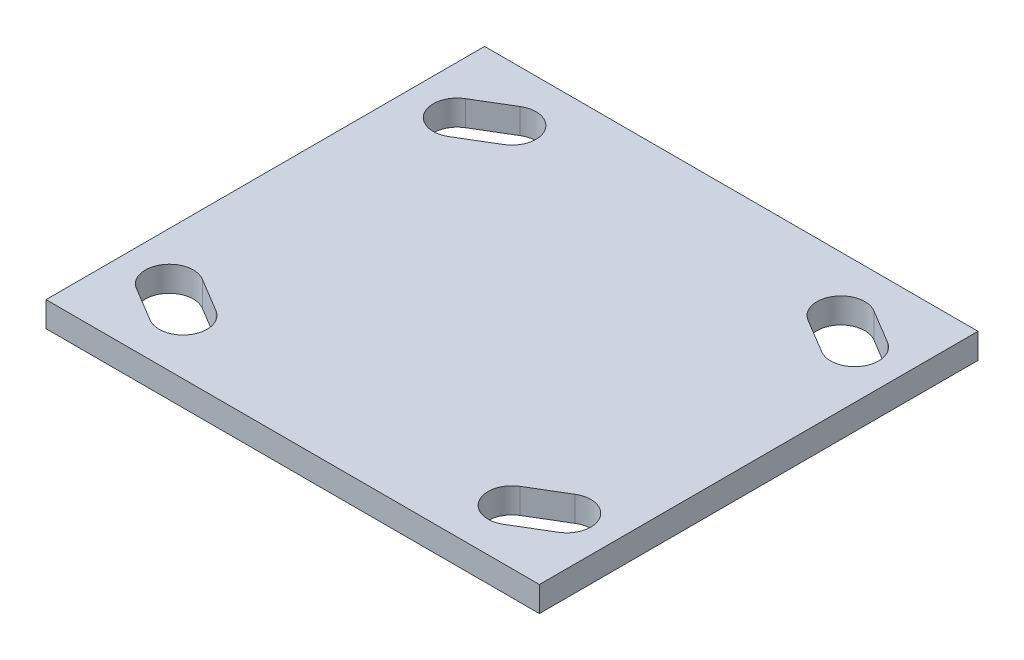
ISO-10303-21;
HEADER;
FILE_DESCRIPTION(('STEP AP214'),'2;1');
FILE_NAME('part.step','',(''),(''),'','','');
FILE_SCHEMA(('AUTOMOTIVE_DESIGN { 1 0 10303 214 1 1 1 1 }'));
ENDSEC;
DATA;
#1=APPLICATION_CONTEXT('core data for automotive mechanical design processes');
#2=APPLICATION_PROTOCOL_DEFINITION('international standard','automotive_design',2000,#1);
#3=PRODUCT_CONTEXT('',#1,'mechanical');
#4=PRODUCT('Part','Part','',(#3));
#5=PRODUCT_RELATED_PRODUCT_CATEGORY('part','',(#4));
#6=PRODUCT_DEFINITION_FORMATION('','',#4);
#7=PRODUCT_DEFINITION_CONTEXT('part definition',#1,'design');
#8=PRODUCT_DEFINITION('design','',#6,#7);
#9=PRODUCT_DEFINITION_SHAPE('','',#8);
#10=(LENGTH_UNIT() NAMED_UNIT(*) SI_UNIT(.MILLI.,.METRE.));
#11=(NAMED_UNIT(*) PLANE_ANGLE_UNIT() SI_UNIT($,.RADIAN.));
#12=(NAMED_UNIT(*) SI_UNIT($,.STERADIAN.) SOLID_ANGLE_UNIT());
#13=UNCERTAINTY_MEASURE_WITH_UNIT(LENGTH_MEASURE(1.E-05),#10,'distance_accuracy_value','');
#14=(GEOMETRIC_REPRESENTATION_CONTEXT(3) GLOBAL_UNCERTAINTY_ASSIGNED_CONTEXT((#13)) GLOBAL_UNIT_ASSIGNED_CONTEXT((#10,
#11,#12)) REPRESENTATION_CONTEXT('',''));
#15=CARTESIAN_POINT('',(0.,0.,0.));
#16=DIRECTION('',(0.,0.,1.));
#17=DIRECTION('',(1.,0.,0.));
#18=AXIS2_PLACEMENT_3D('',#15,#16,#17);
#19=CARTESIAN_POINT('',(-57.15,2.921,50.8));
#20=DIRECTION('',(1.,0.,0.));
#21=DIRECTION('',(0.,0.,-1.));
#22=AXIS2_PLACEMENT_3D('',#19,#20,#21);
#23=PLANE('',#22);
#24=DIRECTION('',(0.,0.,1.));
#25=VECTOR('',#24,1.);
#26=CARTESIAN_POINT('',(-57.15,-2.921,50.8));
#27=LINE('',#26,#25);
#28=CARTESIAN_POINT('',(-57.15,-2.921,-50.8));
#29=VERTEX_POINT('',#28);
#30=CARTESIAN_POINT('',(-57.15,-2.921,50.8));
#31=VERTEX_POINT('',#30);
#32=EDGE_CURVE('E628',#29,#31,#27,.T.);
#33=ORIENTED_EDGE('',*,*,#32,.T.);
#34=DIRECTION('',(0.,-1.,0.));
#35=VECTOR('',#34,1.);
#36=CARTESIAN_POINT('',(-57.15,2.921,50.8));
#37=LINE('',#36,#35);
#38=CARTESIAN_POINT('',(-57.15,2.921,50.8));
#39=VERTEX_POINT('',#38);
#40=EDGE_CURVE('E11',#39,#31,#37,.T.);
#41=ORIENTED_EDGE('',*,*,#40,.F.);
#42=DIRECTION('',(0.,0.,1.));
#43=VECTOR('',#42,1.);
#44=CARTESIAN_POINT('',(-57.15,2.921,50.8));
#45=LINE('',#44,#43);
#46=CARTESIAN_POINT('',(-57.15,2.921,-50.8));
#47=VERTEX_POINT('',#46);
#48=EDGE_CURVE('E637',#47,#39,#45,.T.);
#49=ORIENTED_EDGE('',*,*,#48,.F.);
#50=DIRECTION('',(0.,-1.,0.));
#51=VECTOR('',#50,1.);
#52=CARTESIAN_POINT('',(-57.15,2.921,-50.8));
#53=LINE('',#52,#51);
#54=EDGE_CURVE('E646',#47,#29,#53,.T.);
#55=ORIENTED_EDGE('',*,*,#54,.T.);
#56=EDGE_LOOP('',(#33,#41,#49,#55));
#57=FACE_BOUND('',#56,.T.);
#58=ADVANCED_FACE('F362',(#57),#23,.F.);
#59=CARTESIAN_POINT('',(-57.15,2.921,50.8));
#60=DIRECTION('',(0.,0.,-1.));
#61=DIRECTION('',(-1.,0.,0.));
#62=AXIS2_PLACEMENT_3D('',#59,#60,#61);
#63=PLANE('',#62);
#64=DIRECTION('',(1.,0.,0.));
#65=VECTOR('',#64,1.);
#66=CARTESIAN_POINT('',(-57.15,-2.921,50.8));
#67=LINE('',#66,#65);
#68=CARTESIAN_POINT('',(57.15,-2.921,50.8));
#69=VERTEX_POINT('',#68);
#70=EDGE_CURVE('E631',#31,#69,#67,.T.);
#71=ORIENTED_EDGE('',*,*,#70,.T.);
#72=DIRECTION('',(0.,-1.,0.));
#73=VECTOR('',#72,1.);
#74=CARTESIAN_POINT('',(57.15,2.921,50.8));
#75=LINE('',#74,#73);
#76=CARTESIAN_POINT('',(57.15,2.921,50.8));
#77=VERTEX_POINT('',#76);
#78=EDGE_CURVE('E369',#77,#69,#75,.T.);
#79=ORIENTED_EDGE('',*,*,#78,.F.);
#80=DIRECTION('',(1.,0.,0.));
#81=VECTOR('',#80,1.);
#82=CARTESIAN_POINT('',(-57.15,2.921,50.8));
#83=LINE('',#82,#81);
#84=EDGE_CURVE('E640',#39,#77,#83,.T.);
#85=ORIENTED_EDGE('',*,*,#84,.F.);
#86=ORIENTED_EDGE('',*,*,#40,.T.);
#87=EDGE_LOOP('',(#71,#79,#85,#86));
#88=FACE_BOUND('',#87,.T.);
#89=ADVANCED_FACE('F671',(#88),#63,.F.);
#90=CARTESIAN_POINT('',(57.15,2.921,50.8));
#91=DIRECTION('',(-1.,0.,0.));
#92=DIRECTION('',(0.,0.,1.));
#93=AXIS2_PLACEMENT_3D('',#90,#91,#92);
#94=PLANE('',#93);
#95=DIRECTION('',(0.,0.,-1.));
#96=VECTOR('',#95,1.);
#97=CARTESIAN_POINT('',(57.15,-2.921,50.8));
#98=LINE('',#97,#96);
#99=CARTESIAN_POINT('',(57.15,-2.921,-50.8));
#100=VERTEX_POINT('',#99);
#101=EDGE_CURVE('E633',#69,#100,#98,.T.);
#102=ORIENTED_EDGE('',*,*,#101,.T.);
#103=DIRECTION('',(0.,-1.,0.));
#104=VECTOR('',#103,1.);
#105=CARTESIAN_POINT('',(57.15,2.921,-50.8));
#106=LINE('',#105,#104);
#107=CARTESIAN_POINT('',(57.15,2.921,-50.8));
#108=VERTEX_POINT('',#107);
#109=EDGE_CURVE('E649',#108,#100,#106,.T.);
#110=ORIENTED_EDGE('',*,*,#109,.F.);
#111=DIRECTION('',(0.,0.,-1.));
#112=VECTOR('',#111,1.);
#113=CARTESIAN_POINT('',(57.15,2.921,50.8));
#114=LINE('',#113,#112);
#115=EDGE_CURVE('E642',#77,#108,#114,.T.);
#116=ORIENTED_EDGE('',*,*,#115,.F.);
#117=ORIENTED_EDGE('',*,*,#78,.T.);
#118=EDGE_LOOP('',(#102,#110,#116,#117));
#119=FACE_BOUND('',#118,.T.);
#120=ADVANCED_FACE('F656',(#119),#94,.F.);
#121=CARTESIAN_POINT('',(-57.15,2.921,-50.8));
#122=DIRECTION('',(0.,0.,1.));
#123=DIRECTION('',(1.,0.,0.));
#124=AXIS2_PLACEMENT_3D('',#121,#122,#123);
#125=PLANE('',#124);
#126=DIRECTION('',(-1.,0.,0.));
#127=VECTOR('',#126,1.);
#128=CARTESIAN_POINT('',(-57.15,-2.921,-50.8));
#129=LINE('',#128,#127);
#130=EDGE_CURVE('E635',#100,#29,#129,.T.);
#131=ORIENTED_EDGE('',*,*,#130,.T.);
#132=ORIENTED_EDGE('',*,*,#54,.F.);
#133=DIRECTION('',(-1.,0.,0.));
#134=VECTOR('',#133,1.);
#135=CARTESIAN_POINT('',(-57.15,2.921,-50.8));
#136=LINE('',#135,#134);
#137=EDGE_CURVE('E644',#108,#47,#136,.T.);
#138=ORIENTED_EDGE('',*,*,#137,.F.);
#139=ORIENTED_EDGE('',*,*,#109,.T.);
#140=EDGE_LOOP('',(#131,#132,#138,#139));
#141=FACE_BOUND('',#140,.T.);
#142=ADVANCED_FACE('F664',(#141),#125,.F.);
#143=CARTESIAN_POINT('',(-57.15,2.921,-50.8));
#144=DIRECTION('',(0.,-1.,0.));
#145=DIRECTION('',(0.,0.,-1.));
#146=AXIS2_PLACEMENT_3D('',#143,#144,#145);
#147=PLANE('',#146);
#148=DIRECTION('',(0.857492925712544,0.,0.514495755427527));
#149=VECTOR('',#148,1.);
#150=CARTESIAN_POINT('',(43.1788329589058,2.921,-28.5730549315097));
#151=LINE('',#150,#149);
#152=CARTESIAN_POINT('',(35.2413329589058,2.921,-33.3355549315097));
#153=VERTEX_POINT('',#152);
#154=CARTESIAN_POINT('',(43.1788329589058,2.921,-28.5730549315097));
#155=VERTEX_POINT('',#154);
#156=EDGE_CURVE('E517',#153,#155,#151,.T.);
#157=ORIENTED_EDGE('',*,*,#156,.F.);
#158=CARTESIAN_POINT('',(38.1,2.921,-38.1));
#159=DIRECTION('',(0.,1.,0.));
#160=DIRECTION('',(0.,0.,1.));
#161=AXIS2_PLACEMENT_3D('',#158,#159,#160);
#162=CIRCLE('',#161,5.55624999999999);
#163=CARTESIAN_POINT('',(40.9586670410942,2.921,-42.8644450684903));
#164=VERTEX_POINT('',#163);
#165=EDGE_CURVE('E376',#164,#153,#162,.T.);
#166=ORIENTED_EDGE('',*,*,#165,.F.);
#167=DIRECTION('',(-0.857492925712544,0.,-0.514495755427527));
#168=VECTOR('',#167,1.);
#169=CARTESIAN_POINT('',(40.9586670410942,2.921,-42.8644450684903));
#170=LINE('',#169,#168);
#171=CARTESIAN_POINT('',(48.8961670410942,2.921,-38.1019450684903));
#172=VERTEX_POINT('',#171);
#173=EDGE_CURVE('E510',#172,#164,#170,.T.);
#174=ORIENTED_EDGE('',*,*,#173,.F.);
#175=CARTESIAN_POINT('',(46.0375,2.921,-33.3375));
#176=DIRECTION('',(0.,1.,0.));
#177=DIRECTION('',(0.,0.,1.));
#178=AXIS2_PLACEMENT_3D('',#175,#176,#177);
#179=CIRCLE('',#178,5.55624999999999);
#180=EDGE_CURVE('E524',#155,#172,#179,.T.);
#181=ORIENTED_EDGE('',*,*,#180,.F.);
#182=EDGE_LOOP('',(#157,#166,#174,#181));
#183=FACE_BOUND('',#182,.T.);
#184=DIRECTION('',(0.857492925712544,0.,-0.514495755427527));
#185=VECTOR('',#184,1.);
#186=CARTESIAN_POINT('',(-35.2413329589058,2.921,-33.3355549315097));
#187=LINE('',#186,#185);
#188=CARTESIAN_POINT('',(-43.1788329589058,2.921,-28.5730549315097));
#189=VERTEX_POINT('',#188);
#190=CARTESIAN_POINT('',(-35.2413329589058,2.921,-33.3355549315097));
#191=VERTEX_POINT('',#190);
#192=EDGE_CURVE('E543',#189,#191,#187,.T.);
#193=ORIENTED_EDGE('',*,*,#192,.F.);
#194=CARTESIAN_POINT('',(-46.0375,2.921,-33.3375));
#195=DIRECTION('',(0.,1.,0.));
#196=DIRECTION('',(0.,0.,1.));
#197=AXIS2_PLACEMENT_3D('',#194,#195,#196);
#198=CIRCLE('',#197,5.55625000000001);
#199=CARTESIAN_POINT('',(-48.8961670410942,2.921,-38.1019450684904));
#200=VERTEX_POINT('',#199);
#201=EDGE_CURVE('E541',#200,#189,#198,.T.);
#202=ORIENTED_EDGE('',*,*,#201,.F.);
#203=DIRECTION('',(-0.857492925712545,0.,0.514495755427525));
#204=VECTOR('',#203,1.);
#205=CARTESIAN_POINT('',(-48.8961670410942,2.921,-38.1019450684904));
#206=LINE('',#205,#204);
#207=CARTESIAN_POINT('',(-40.9586670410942,2.921,-42.8644450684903));
#208=VERTEX_POINT('',#207);
#209=EDGE_CURVE('E549',#208,#200,#206,.T.);
#210=ORIENTED_EDGE('',*,*,#209,.F.);
#211=CARTESIAN_POINT('',(-38.1,2.921,-38.1));
#212=DIRECTION('',(0.,1.,0.));
#213=DIRECTION('',(0.,0.,1.));
#214=AXIS2_PLACEMENT_3D('',#211,#212,#213);
#215=CIRCLE('',#214,5.55624999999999);
#216=EDGE_CURVE('E546',#191,#208,#215,.T.);
#217=ORIENTED_EDGE('',*,*,#216,.F.);
#218=EDGE_LOOP('',(#193,#202,#210,#217));
#219=FACE_BOUND('',#218,.T.);
#220=DIRECTION('',(0.857492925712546,0.,0.514495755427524));
#221=VECTOR('',#220,1.);
#222=CARTESIAN_POINT('',(-48.8961670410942,2.921,38.1019450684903));
#223=LINE('',#222,#221);
#224=CARTESIAN_POINT('',(-48.8961670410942,2.921,38.1019450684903));
#225=VERTEX_POINT('',#224);
#226=CARTESIAN_POINT('',(-40.9586670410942,2.921,42.8644450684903));
#227=VERTEX_POINT('',#226);
#228=EDGE_CURVE('E575',#225,#227,#223,.T.);
#229=ORIENTED_EDGE('',*,*,#228,.F.);
#230=CARTESIAN_POINT('',(-46.0375,2.921,33.3375));
#231=DIRECTION('',(0.,1.,0.));
#232=DIRECTION('',(0.,0.,1.));
#233=AXIS2_PLACEMENT_3D('',#230,#231,#232);
#234=CIRCLE('',#233,5.55625000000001);
#235=CARTESIAN_POINT('',(-43.1788329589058,2.921,28.5730549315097));
#236=VERTEX_POINT('',#235);
#237=EDGE_CURVE('E573',#236,#225,#234,.T.);
#238=ORIENTED_EDGE('',*,*,#237,.F.);
#239=DIRECTION('',(-0.857492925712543,0.,-0.514495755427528));
#240=VECTOR('',#239,1.);
#241=CARTESIAN_POINT('',(-35.2413329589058,2.921,33.3355549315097));
#242=LINE('',#241,#240);
#243=CARTESIAN_POINT('',(-35.2413329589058,2.921,33.3355549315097));
#244=VERTEX_POINT('',#243);
#245=EDGE_CURVE('E581',#244,#236,#242,.T.);
#246=ORIENTED_EDGE('',*,*,#245,.F.);
#247=CARTESIAN_POINT('',(-38.1,2.921,38.1));
#248=DIRECTION('',(0.,1.,0.));
#249=DIRECTION('',(0.,0.,1.));
#250=AXIS2_PLACEMENT_3D('',#247,#248,#249);
#251=CIRCLE('',#250,5.55624999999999);
#252=EDGE_CURVE('E578',#227,#244,#251,.T.);
#253=ORIENTED_EDGE('',*,*,#252,.F.);
#254=EDGE_LOOP('',(#229,#238,#246,#253));
#255=FACE_BOUND('',#254,.T.);
#256=DIRECTION('',(-0.857492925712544,0.,0.514495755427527));
#257=VECTOR('',#256,1.);
#258=CARTESIAN_POINT('',(43.1788329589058,2.921,28.5730549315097));
#259=LINE('',#258,#257);
#260=CARTESIAN_POINT('',(43.1788329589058,2.921,28.5730549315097));
#261=VERTEX_POINT('',#260);
#262=CARTESIAN_POINT('',(35.2413329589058,2.921,33.3355549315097));
#263=VERTEX_POINT('',#262);
#264=EDGE_CURVE('E607',#261,#263,#259,.T.);
#265=ORIENTED_EDGE('',*,*,#264,.F.);
#266=CARTESIAN_POINT('',(46.0375,2.921,33.3375));
#267=DIRECTION('',(0.,1.,0.));
#268=DIRECTION('',(0.,0.,1.));
#269=AXIS2_PLACEMENT_3D('',#266,#267,#268);
#270=CIRCLE('',#269,5.55625000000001);
#271=CARTESIAN_POINT('',(48.8961670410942,2.921,38.1019450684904));
#272=VERTEX_POINT('',#271);
#273=EDGE_CURVE('E605',#272,#261,#270,.T.);
#274=ORIENTED_EDGE('',*,*,#273,.F.);
#275=DIRECTION('',(0.857492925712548,0.,-0.514495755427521));
#276=VECTOR('',#275,1.);
#277=CARTESIAN_POINT('',(40.9586670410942,2.921,42.8644450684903));
#278=LINE('',#277,#276);
#279=CARTESIAN_POINT('',(40.9586670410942,2.921,42.8644450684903));
#280=VERTEX_POINT('',#279);
#281=EDGE_CURVE('E613',#280,#272,#278,.T.);
#282=ORIENTED_EDGE('',*,*,#281,.F.);
#283=CARTESIAN_POINT('',(38.1,2.921,38.1));
#284=DIRECTION('',(0.,1.,0.));
#285=DIRECTION('',(0.,0.,1.));
#286=AXIS2_PLACEMENT_3D('',#283,#284,#285);
#287=CIRCLE('',#286,5.55624999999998);
#288=EDGE_CURVE('E610',#263,#280,#287,.T.);
#289=ORIENTED_EDGE('',*,*,#288,.F.);
#290=EDGE_LOOP('',(#265,#274,#282,#289));
#291=FACE_BOUND('',#290,.T.);
#292=ORIENTED_EDGE('',*,*,#48,.T.);
#293=ORIENTED_EDGE('',*,*,#84,.T.);
#294=ORIENTED_EDGE('',*,*,#115,.T.);
#295=ORIENTED_EDGE('',*,*,#137,.T.);
#296=EDGE_LOOP('',(#292,#293,#294,#295));
#297=FACE_BOUND('',#296,.T.);
#298=ADVANCED_FACE('F670',(#183,#219,#255,#291,#297),#147,.F.);
#299=CARTESIAN_POINT('',(-57.15,-2.921,-50.8));
#300=DIRECTION('',(0.,-1.,0.));
#301=DIRECTION('',(0.,0.,-1.));
#302=AXIS2_PLACEMENT_3D('',#299,#300,#301);
#303=PLANE('',#302);
#304=CARTESIAN_POINT('',(38.1,-2.921,-38.1));
#305=DIRECTION('',(0.,-1.,0.));
#306=DIRECTION('',(0.,0.,-1.));
#307=AXIS2_PLACEMENT_3D('',#304,#305,#306);
#308=CIRCLE('',#307,5.55624999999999);
#309=CARTESIAN_POINT('',(40.9586670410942,-2.921,-42.8644450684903));
#310=VERTEX_POINT('',#309);
#311=CARTESIAN_POINT('',(35.2413329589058,-2.921,-33.3355549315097));
#312=VERTEX_POINT('',#311);
#313=EDGE_CURVE('E508',#310,#312,#308,.F.);
#314=ORIENTED_EDGE('',*,*,#313,.T.);
#315=DIRECTION('',(0.857492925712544,0.,0.514495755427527));
#316=VECTOR('',#315,1.);
#317=CARTESIAN_POINT('',(43.1788329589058,-2.921,-28.5730549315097));
#318=LINE('',#317,#316);
#319=CARTESIAN_POINT('',(43.1788329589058,-2.921,-28.5730549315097));
#320=VERTEX_POINT('',#319);
#321=EDGE_CURVE('E497',#312,#320,#318,.T.);
#322=ORIENTED_EDGE('',*,*,#321,.T.);
#323=CARTESIAN_POINT('',(46.0375,-2.921,-33.3375));
#324=DIRECTION('',(0.,-1.,0.));
#325=DIRECTION('',(0.,0.,-1.));
#326=AXIS2_PLACEMENT_3D('',#323,#324,#325);
#327=CIRCLE('',#326,5.55624999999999);
#328=CARTESIAN_POINT('',(48.8961670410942,-2.921,-38.1019450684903));
#329=VERTEX_POINT('',#328);
#330=EDGE_CURVE('E519',#320,#329,#327,.F.);
#331=ORIENTED_EDGE('',*,*,#330,.T.);
#332=DIRECTION('',(-0.857492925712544,0.,-0.514495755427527));
#333=VECTOR('',#332,1.);
#334=CARTESIAN_POINT('',(40.9586670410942,-2.921,-42.8644450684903));
#335=LINE('',#334,#333);
#336=EDGE_CURVE('E515',#329,#310,#335,.T.);
#337=ORIENTED_EDGE('',*,*,#336,.T.);
#338=EDGE_LOOP('',(#314,#322,#331,#337));
#339=FACE_BOUND('',#338,.T.);
#340=CARTESIAN_POINT('',(-46.0375,-2.921,-33.3375));
#341=DIRECTION('',(0.,-1.,0.));
#342=DIRECTION('',(0.,0.,-1.));
#343=AXIS2_PLACEMENT_3D('',#340,#341,#342);
#344=CIRCLE('',#343,5.55625000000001);
#345=CARTESIAN_POINT('',(-48.8961670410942,-2.921,-38.1019450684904));
#346=VERTEX_POINT('',#345);
#347=CARTESIAN_POINT('',(-43.1788329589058,-2.921,-28.5730549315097));
#348=VERTEX_POINT('',#347);
#349=EDGE_CURVE('E538',#346,#348,#344,.F.);
#350=ORIENTED_EDGE('',*,*,#349,.T.);
#351=DIRECTION('',(0.857492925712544,0.,-0.514495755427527));
#352=VECTOR('',#351,1.);
#353=CARTESIAN_POINT('',(-35.2413329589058,-2.921,-33.3355549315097));
#354=LINE('',#353,#352);
#355=CARTESIAN_POINT('',(-35.2413329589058,-2.921,-33.3355549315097));
#356=VERTEX_POINT('',#355);
#357=EDGE_CURVE('E555',#348,#356,#354,.T.);
#358=ORIENTED_EDGE('',*,*,#357,.T.);
#359=CARTESIAN_POINT('',(-38.1,-2.921,-38.1));
#360=DIRECTION('',(0.,-1.,0.));
#361=DIRECTION('',(0.,0.,-1.));
#362=AXIS2_PLACEMENT_3D('',#359,#360,#361);
#363=CIRCLE('',#362,5.55624999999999);
#364=CARTESIAN_POINT('',(-40.9586670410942,-2.921,-42.8644450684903));
#365=VERTEX_POINT('',#364);
#366=EDGE_CURVE('E504',#356,#365,#363,.F.);
#367=ORIENTED_EDGE('',*,*,#366,.T.);
#368=DIRECTION('',(-0.857492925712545,0.,0.514495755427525));
#369=VECTOR('',#368,1.);
#370=CARTESIAN_POINT('',(-48.8961670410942,-2.921,-38.1019450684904));
#371=LINE('',#370,#369);
#372=EDGE_CURVE('E535',#365,#346,#371,.T.);
#373=ORIENTED_EDGE('',*,*,#372,.T.);
#374=EDGE_LOOP('',(#350,#358,#367,#373));
#375=FACE_BOUND('',#374,.T.);
#376=CARTESIAN_POINT('',(-46.0375,-2.921,33.3375));
#377=DIRECTION('',(0.,-1.,0.));
#378=DIRECTION('',(0.,0.,-1.));
#379=AXIS2_PLACEMENT_3D('',#376,#377,#378);
#380=CIRCLE('',#379,5.55625000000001);
#381=CARTESIAN_POINT('',(-43.1788329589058,-2.921,28.5730549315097));
#382=VERTEX_POINT('',#381);
#383=CARTESIAN_POINT('',(-48.8961670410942,-2.921,38.1019450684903));
#384=VERTEX_POINT('',#383);
#385=EDGE_CURVE('E570',#382,#384,#380,.F.);
#386=ORIENTED_EDGE('',*,*,#385,.T.);
#387=DIRECTION('',(0.857492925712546,0.,0.514495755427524));
#388=VECTOR('',#387,1.);
#389=CARTESIAN_POINT('',(-48.8961670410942,-2.921,38.1019450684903));
#390=LINE('',#389,#388);
#391=CARTESIAN_POINT('',(-40.9586670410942,-2.921,42.8644450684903));
#392=VERTEX_POINT('',#391);
#393=EDGE_CURVE('E587',#384,#392,#390,.T.);
#394=ORIENTED_EDGE('',*,*,#393,.T.);
#395=CARTESIAN_POINT('',(-38.1,-2.921,38.1));
#396=DIRECTION('',(0.,-1.,0.));
#397=DIRECTION('',(0.,0.,-1.));
#398=AXIS2_PLACEMENT_3D('',#395,#396,#397);
#399=CIRCLE('',#398,5.55624999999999);
#400=CARTESIAN_POINT('',(-35.2413329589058,-2.921,33.3355549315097));
#401=VERTEX_POINT('',#400);
#402=EDGE_CURVE('E564',#392,#401,#399,.F.);
#403=ORIENTED_EDGE('',*,*,#402,.T.);
#404=DIRECTION('',(-0.857492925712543,0.,-0.514495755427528));
#405=VECTOR('',#404,1.);
#406=CARTESIAN_POINT('',(-35.2413329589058,-2.921,33.3355549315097));
#407=LINE('',#406,#405);
#408=EDGE_CURVE('E567',#401,#382,#407,.T.);
#409=ORIENTED_EDGE('',*,*,#408,.T.);
#410=EDGE_LOOP('',(#386,#394,#403,#409));
#411=FACE_BOUND('',#410,.T.);
#412=CARTESIAN_POINT('',(46.0375,-2.921,33.3375));
#413=DIRECTION('',(0.,-1.,0.));
#414=DIRECTION('',(0.,0.,-1.));
#415=AXIS2_PLACEMENT_3D('',#412,#413,#414);
#416=CIRCLE('',#415,5.55625000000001);
#417=CARTESIAN_POINT('',(48.8961670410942,-2.921,38.1019450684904));
#418=VERTEX_POINT('',#417);
#419=CARTESIAN_POINT('',(43.1788329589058,-2.921,28.5730549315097));
#420=VERTEX_POINT('',#419);
#421=EDGE_CURVE('E602',#418,#420,#416,.F.);
#422=ORIENTED_EDGE('',*,*,#421,.T.);
#423=DIRECTION('',(-0.857492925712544,0.,0.514495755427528));
#424=VECTOR('',#423,1.);
#425=CARTESIAN_POINT('',(43.1788329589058,-2.921,28.5730549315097));
#426=LINE('',#425,#424);
#427=CARTESIAN_POINT('',(35.2413329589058,-2.921,33.3355549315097));
#428=VERTEX_POINT('',#427);
#429=EDGE_CURVE('E619',#420,#428,#426,.T.);
#430=ORIENTED_EDGE('',*,*,#429,.T.);
#431=CARTESIAN_POINT('',(38.1,-2.921,38.1));
#432=DIRECTION('',(0.,-1.,0.));
#433=DIRECTION('',(0.,0.,-1.));
#434=AXIS2_PLACEMENT_3D('',#431,#432,#433);
#435=CIRCLE('',#434,5.55624999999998);
#436=CARTESIAN_POINT('',(40.9586670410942,-2.921,42.8644450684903));
#437=VERTEX_POINT('',#436);
#438=EDGE_CURVE('E596',#428,#437,#435,.F.);
#439=ORIENTED_EDGE('',*,*,#438,.T.);
#440=DIRECTION('',(0.857492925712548,0.,-0.514495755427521));
#441=VECTOR('',#440,1.);
#442=CARTESIAN_POINT('',(40.9586670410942,-2.921,42.8644450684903));
#443=LINE('',#442,#441);
#444=EDGE_CURVE('E599',#437,#418,#443,.T.);
#445=ORIENTED_EDGE('',*,*,#444,.T.);
#446=EDGE_LOOP('',(#422,#430,#439,#445));
#447=FACE_BOUND('',#446,.T.);
#448=ORIENTED_EDGE('',*,*,#32,.F.);
#449=ORIENTED_EDGE('',*,*,#130,.F.);
#450=ORIENTED_EDGE('',*,*,#101,.F.);
#451=ORIENTED_EDGE('',*,*,#70,.F.);
#452=EDGE_LOOP('',(#448,#449,#450,#451));
#453=FACE_BOUND('',#452,.T.);
#454=ADVANCED_FACE('F513',(#339,#375,#411,#447,#453),#303,.T.);
#455=CARTESIAN_POINT('',(46.0375,-2.922,33.3375));
#456=DIRECTION('',(0.,1.,0.));
#457=DIRECTION('',(0.,0.,1.));
#458=AXIS2_PLACEMENT_3D('',#455,#456,#457);
#459=CYLINDRICAL_SURFACE('',#458,5.55625000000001);
#460=DIRECTION('',(0.,1.,0.));
#461=VECTOR('',#460,1.);
#462=CARTESIAN_POINT('',(48.8961670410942,-2.922,38.1019450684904));
#463=LINE('',#462,#461);
#464=EDGE_CURVE('E617',#418,#272,#463,.T.);
#465=ORIENTED_EDGE('',*,*,#464,.T.);
#466=ORIENTED_EDGE('',*,*,#273,.T.);
#467=DIRECTION('',(0.,1.,0.));
#468=VECTOR('',#467,1.);
#469=CARTESIAN_POINT('',(43.1788329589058,-2.922,28.5730549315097));
#470=LINE('',#469,#468);
#471=EDGE_CURVE('E616',#420,#261,#470,.T.);
#472=ORIENTED_EDGE('',*,*,#471,.F.);
#473=ORIENTED_EDGE('',*,*,#421,.F.);
#474=EDGE_LOOP('',(#465,#466,#472,#473));
#475=FACE_BOUND('',#474,.T.);
#476=ADVANCED_FACE('F686',(#475),#459,.F.);
#477=CARTESIAN_POINT('',(40.9586670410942,-2.922,42.8644450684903));
#478=DIRECTION('',(0.514495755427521,0.,0.857492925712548));
#479=DIRECTION('',(0.857492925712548,0.,-0.514495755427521));
#480=AXIS2_PLACEMENT_3D('',#477,#478,#479);
#481=PLANE('',#480);
#482=DIRECTION('',(0.,1.,0.));
#483=VECTOR('',#482,1.);
#484=CARTESIAN_POINT('',(40.9586670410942,-2.922,42.8644450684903));
#485=LINE('',#484,#483);
#486=EDGE_CURVE('E620',#437,#280,#485,.T.);
#487=ORIENTED_EDGE('',*,*,#486,.T.);
#488=ORIENTED_EDGE('',*,*,#281,.T.);
#489=ORIENTED_EDGE('',*,*,#464,.F.);
#490=ORIENTED_EDGE('',*,*,#444,.F.);
#491=EDGE_LOOP('',(#487,#488,#489,#490));
#492=FACE_BOUND('',#491,.T.);
#493=ADVANCED_FACE('F689',(#492),#481,.F.);
#494=CARTESIAN_POINT('',(38.1,-2.922,38.1));
#495=DIRECTION('',(0.,1.,0.));
#496=DIRECTION('',(0.,0.,1.));
#497=AXIS2_PLACEMENT_3D('',#494,#495,#496);
#498=CYLINDRICAL_SURFACE('',#497,5.55624999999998);
#499=DIRECTION('',(0.,1.,0.));
#500=VECTOR('',#499,1.);
#501=CARTESIAN_POINT('',(35.2413329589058,-2.922,33.3355549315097));
#502=LINE('',#501,#500);
#503=EDGE_CURVE('E622',#428,#263,#502,.T.);
#504=ORIENTED_EDGE('',*,*,#503,.T.);
#505=ORIENTED_EDGE('',*,*,#288,.T.);
#506=ORIENTED_EDGE('',*,*,#486,.F.);
#507=ORIENTED_EDGE('',*,*,#438,.F.);
#508=EDGE_LOOP('',(#504,#505,#506,#507));
#509=FACE_BOUND('',#508,.T.);
#510=ADVANCED_FACE('F695',(#509),#498,.F.);
#511=CARTESIAN_POINT('',(43.1788329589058,-2.922,28.5730549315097));
#512=DIRECTION('',(-0.514495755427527,0.,-0.857492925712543));
#513=DIRECTION('',(-0.857492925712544,0.,0.514495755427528));
#514=AXIS2_PLACEMENT_3D('',#511,#512,#513);
#515=PLANE('',#514);
#516=ORIENTED_EDGE('',*,*,#471,.T.);
#517=ORIENTED_EDGE('',*,*,#264,.T.);
#518=ORIENTED_EDGE('',*,*,#503,.F.);
#519=ORIENTED_EDGE('',*,*,#429,.F.);
#520=EDGE_LOOP('',(#516,#517,#518,#519));
#521=FACE_BOUND('',#520,.T.);
#522=ADVANCED_FACE('F691',(#521),#515,.F.);
#523=CARTESIAN_POINT('',(-46.0375,-2.922,33.3375));
#524=DIRECTION('',(0.,1.,0.));
#525=DIRECTION('',(0.,0.,1.));
#526=AXIS2_PLACEMENT_3D('',#523,#524,#525);
#527=CYLINDRICAL_SURFACE('',#526,5.55625000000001);
#528=DIRECTION('',(0.,1.,0.));
#529=VECTOR('',#528,1.);
#530=CARTESIAN_POINT('',(-43.1788329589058,-2.922,28.5730549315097));
#531=LINE('',#530,#529);
#532=EDGE_CURVE('E585',#382,#236,#531,.T.);
#533=ORIENTED_EDGE('',*,*,#532,.T.);
#534=ORIENTED_EDGE('',*,*,#237,.T.);
#535=DIRECTION('',(0.,1.,0.));
#536=VECTOR('',#535,1.);
#537=CARTESIAN_POINT('',(-48.8961670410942,-2.922,38.1019450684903));
#538=LINE('',#537,#536);
#539=EDGE_CURVE('E584',#384,#225,#538,.T.);
#540=ORIENTED_EDGE('',*,*,#539,.F.);
#541=ORIENTED_EDGE('',*,*,#385,.F.);
#542=EDGE_LOOP('',(#533,#534,#540,#541));
#543=FACE_BOUND('',#542,.T.);
#544=ADVANCED_FACE('F694',(#543),#527,.F.);
#545=CARTESIAN_POINT('',(-35.2413329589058,-2.922,33.3355549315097));
#546=DIRECTION('',(0.514495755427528,0.,-0.857492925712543));
#547=DIRECTION('',(-0.857492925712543,0.,-0.514495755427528));
#548=AXIS2_PLACEMENT_3D('',#545,#546,#547);
#549=PLANE('',#548);
#550=DIRECTION('',(0.,1.,0.));
#551=VECTOR('',#550,1.);
#552=CARTESIAN_POINT('',(-35.2413329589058,-2.922,33.3355549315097));
#553=LINE('',#552,#551);
#554=EDGE_CURVE('E588',#401,#244,#553,.T.);
#555=ORIENTED_EDGE('',*,*,#554,.T.);
#556=ORIENTED_EDGE('',*,*,#245,.T.);
#557=ORIENTED_EDGE('',*,*,#532,.F.);
#558=ORIENTED_EDGE('',*,*,#408,.F.);
#559=EDGE_LOOP('',(#555,#556,#557,#558));
#560=FACE_BOUND('',#559,.T.);
#561=ADVANCED_FACE('F705',(#560),#549,.F.);
#562=CARTESIAN_POINT('',(-38.1,-2.922,38.1));
#563=DIRECTION('',(0.,1.,0.));
#564=DIRECTION('',(0.,0.,1.));
#565=AXIS2_PLACEMENT_3D('',#562,#563,#564);
#566=CYLINDRICAL_SURFACE('',#565,5.55624999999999);
#567=DIRECTION('',(0.,1.,0.));
#568=VECTOR('',#567,1.);
#569=CARTESIAN_POINT('',(-40.9586670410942,-2.922,42.8644450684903));
#570=LINE('',#569,#568);
#571=EDGE_CURVE('E590',#392,#227,#570,.T.);
#572=ORIENTED_EDGE('',*,*,#571,.T.);
#573=ORIENTED_EDGE('',*,*,#252,.T.);
#574=ORIENTED_EDGE('',*,*,#554,.F.);
#575=ORIENTED_EDGE('',*,*,#402,.F.);
#576=EDGE_LOOP('',(#572,#573,#574,#575));
#577=FACE_BOUND('',#576,.T.);
#578=ADVANCED_FACE('F711',(#577),#566,.F.);
#579=CARTESIAN_POINT('',(-48.8961670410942,-2.922,38.1019450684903));
#580=DIRECTION('',(-0.514495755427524,0.,0.857492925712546));
#581=DIRECTION('',(0.857492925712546,0.,0.514495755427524));
#582=AXIS2_PLACEMENT_3D('',#579,#580,#581);
#583=PLANE('',#582);
#584=ORIENTED_EDGE('',*,*,#539,.T.);
#585=ORIENTED_EDGE('',*,*,#228,.T.);
#586=ORIENTED_EDGE('',*,*,#571,.F.);
#587=ORIENTED_EDGE('',*,*,#393,.F.);
#588=EDGE_LOOP('',(#584,#585,#586,#587));
#589=FACE_BOUND('',#588,.T.);
#590=ADVANCED_FACE('F707',(#589),#583,.F.);
#591=CARTESIAN_POINT('',(-46.0375,-2.922,-33.3375));
#592=DIRECTION('',(0.,1.,0.));
#593=DIRECTION('',(0.,0.,1.));
#594=AXIS2_PLACEMENT_3D('',#591,#592,#593);
#595=CYLINDRICAL_SURFACE('',#594,5.55625000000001);
#596=DIRECTION('',(0.,1.,0.));
#597=VECTOR('',#596,1.);
#598=CARTESIAN_POINT('',(-48.8961670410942,-2.922,-38.1019450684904));
#599=LINE('',#598,#597);
#600=EDGE_CURVE('E553',#346,#200,#599,.T.);
#601=ORIENTED_EDGE('',*,*,#600,.T.);
#602=ORIENTED_EDGE('',*,*,#201,.T.);
#603=DIRECTION('',(0.,1.,0.));
#604=VECTOR('',#603,1.);
#605=CARTESIAN_POINT('',(-43.1788329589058,-2.922,-28.5730549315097));
#606=LINE('',#605,#604);
#607=EDGE_CURVE('E552',#348,#189,#606,.T.);
#608=ORIENTED_EDGE('',*,*,#607,.F.);
#609=ORIENTED_EDGE('',*,*,#349,.F.);
#610=EDGE_LOOP('',(#601,#602,#608,#609));
#611=FACE_BOUND('',#610,.T.);
#612=ADVANCED_FACE('F710',(#611),#595,.F.);
#613=CARTESIAN_POINT('',(-48.8961670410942,-2.922,-38.1019450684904));
#614=DIRECTION('',(-0.514495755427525,0.,-0.857492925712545));
#615=DIRECTION('',(-0.857492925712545,0.,0.514495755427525));
#616=AXIS2_PLACEMENT_3D('',#613,#614,#615);
#617=PLANE('',#616);
#618=DIRECTION('',(0.,1.,0.));
#619=VECTOR('',#618,1.);
#620=CARTESIAN_POINT('',(-40.9586670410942,-2.922,-42.8644450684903));
#621=LINE('',#620,#619);
#622=EDGE_CURVE('E556',#365,#208,#621,.T.);
#623=ORIENTED_EDGE('',*,*,#622,.T.);
#624=ORIENTED_EDGE('',*,*,#209,.T.);
#625=ORIENTED_EDGE('',*,*,#600,.F.);
#626=ORIENTED_EDGE('',*,*,#372,.F.);
#627=EDGE_LOOP('',(#623,#624,#625,#626));
#628=FACE_BOUND('',#627,.T.);
#629=ADVANCED_FACE('F721',(#628),#617,.F.);
#630=CARTESIAN_POINT('',(-38.1,-2.922,-38.1));
#631=DIRECTION('',(0.,1.,0.));
#632=DIRECTION('',(0.,0.,1.));
#633=AXIS2_PLACEMENT_3D('',#630,#631,#632);
#634=CYLINDRICAL_SURFACE('',#633,5.55624999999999);
#635=DIRECTION('',(0.,1.,0.));
#636=VECTOR('',#635,1.);
#637=CARTESIAN_POINT('',(-35.2413329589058,-2.922,-33.3355549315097));
#638=LINE('',#637,#636);
#639=EDGE_CURVE('E558',#356,#191,#638,.T.);
#640=ORIENTED_EDGE('',*,*,#639,.T.);
#641=ORIENTED_EDGE('',*,*,#216,.T.);
#642=ORIENTED_EDGE('',*,*,#622,.F.);
#643=ORIENTED_EDGE('',*,*,#366,.F.);
#644=EDGE_LOOP('',(#640,#641,#642,#643));
#645=FACE_BOUND('',#644,.T.);
#646=ADVANCED_FACE('F726',(#645),#634,.F.);
#647=CARTESIAN_POINT('',(-35.2413329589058,-2.922,-33.3355549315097));
#648=DIRECTION('',(0.514495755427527,0.,0.857492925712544));
#649=DIRECTION('',(0.857492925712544,0.,-0.514495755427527));
#650=AXIS2_PLACEMENT_3D('',#647,#648,#649);
#651=PLANE('',#650);
#652=ORIENTED_EDGE('',*,*,#607,.T.);
#653=ORIENTED_EDGE('',*,*,#192,.T.);
#654=ORIENTED_EDGE('',*,*,#639,.F.);
#655=ORIENTED_EDGE('',*,*,#357,.F.);
#656=EDGE_LOOP('',(#652,#653,#654,#655));
#657=FACE_BOUND('',#656,.T.);
#658=ADVANCED_FACE('F723',(#657),#651,.F.);
#659=CARTESIAN_POINT('',(38.1,-2.922,-38.1));
#660=DIRECTION('',(0.,1.,0.));
#661=DIRECTION('',(0.,0.,1.));
#662=AXIS2_PLACEMENT_3D('',#659,#660,#661);
#663=CYLINDRICAL_SURFACE('',#662,5.55624999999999);
#664=DIRECTION('',(0.,1.,0.));
#665=VECTOR('',#664,1.);
#666=CARTESIAN_POINT('',(40.9586670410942,-2.922,-42.8644450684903));
#667=LINE('',#666,#665);
#668=EDGE_CURVE('E505',#310,#164,#667,.T.);
#669=ORIENTED_EDGE('',*,*,#668,.T.);
#670=ORIENTED_EDGE('',*,*,#165,.T.);
#671=DIRECTION('',(0.,1.,0.));
#672=VECTOR('',#671,1.);
#673=CARTESIAN_POINT('',(35.2413329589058,-2.922,-33.3355549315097));
#674=LINE('',#673,#672);
#675=EDGE_CURVE('E499',#312,#153,#674,.T.);
#676=ORIENTED_EDGE('',*,*,#675,.F.);
#677=ORIENTED_EDGE('',*,*,#313,.F.);
#678=EDGE_LOOP('',(#669,#670,#676,#677));
#679=FACE_BOUND('',#678,.T.);
#680=ADVANCED_FACE('F507',(#679),#663,.F.);
#681=CARTESIAN_POINT('',(40.9586670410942,-2.922,-42.8644450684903));
#682=DIRECTION('',(0.514495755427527,0.,-0.857492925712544));
#683=DIRECTION('',(-0.857492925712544,0.,-0.514495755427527));
#684=AXIS2_PLACEMENT_3D('',#681,#682,#683);
#685=PLANE('',#684);
#686=DIRECTION('',(0.,1.,0.));
#687=VECTOR('',#686,1.);
#688=CARTESIAN_POINT('',(48.8961670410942,-2.922,-38.1019450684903));
#689=LINE('',#688,#687);
#690=EDGE_CURVE('E530',#329,#172,#689,.T.);
#691=ORIENTED_EDGE('',*,*,#690,.T.);
#692=ORIENTED_EDGE('',*,*,#173,.T.);
#693=ORIENTED_EDGE('',*,*,#668,.F.);
#694=ORIENTED_EDGE('',*,*,#336,.F.);
#695=EDGE_LOOP('',(#691,#692,#693,#694));
#696=FACE_BOUND('',#695,.T.);
#697=ADVANCED_FACE('F736',(#696),#685,.F.);
#698=CARTESIAN_POINT('',(46.0375,-2.922,-33.3375));
#699=DIRECTION('',(0.,1.,0.));
#700=DIRECTION('',(0.,0.,1.));
#701=AXIS2_PLACEMENT_3D('',#698,#699,#700);
#702=CYLINDRICAL_SURFACE('',#701,5.55624999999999);
#703=DIRECTION('',(0.,1.,0.));
#704=VECTOR('',#703,1.);
#705=CARTESIAN_POINT('',(43.1788329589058,-2.922,-28.5730549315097));
#706=LINE('',#705,#704);
#707=EDGE_CURVE('E384',#320,#155,#706,.T.);
#708=ORIENTED_EDGE('',*,*,#707,.T.);
#709=ORIENTED_EDGE('',*,*,#180,.T.);
#710=ORIENTED_EDGE('',*,*,#690,.F.);
#711=ORIENTED_EDGE('',*,*,#330,.F.);
#712=EDGE_LOOP('',(#708,#709,#710,#711));
#713=FACE_BOUND('',#712,.T.);
#714=ADVANCED_FACE('F739',(#713),#702,.F.);
#715=CARTESIAN_POINT('',(43.1788329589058,-2.922,-28.5730549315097));
#716=DIRECTION('',(-0.514495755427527,0.,0.857492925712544));
#717=DIRECTION('',(0.857492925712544,0.,0.514495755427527));
#718=AXIS2_PLACEMENT_3D('',#715,#716,#717);
#719=PLANE('',#718);
#720=ORIENTED_EDGE('',*,*,#675,.T.);
#721=ORIENTED_EDGE('',*,*,#156,.T.);
#722=ORIENTED_EDGE('',*,*,#707,.F.);
#723=ORIENTED_EDGE('',*,*,#321,.F.);
#724=EDGE_LOOP('',(#720,#721,#722,#723));
#725=FACE_BOUND('',#724,.T.);
#726=ADVANCED_FACE('F498',(#725),#719,.F.);
#727=CLOSED_SHELL('',(#58,#89,#120,#142,#298,#454,#476,#493,#510,#522,#544,#561,#578,#590,#612,
#629,#646,#658,#680,#697,#714,#726));
#728=MANIFOLD_SOLID_BREP('B2',#727);
#729=ADVANCED_BREP_SHAPE_REPRESENTATION('',(#18,#728),#14);
#730=SHAPE_DEFINITION_REPRESENTATION(#9,#729);
ENDSEC;
END-ISO-10303-21;
